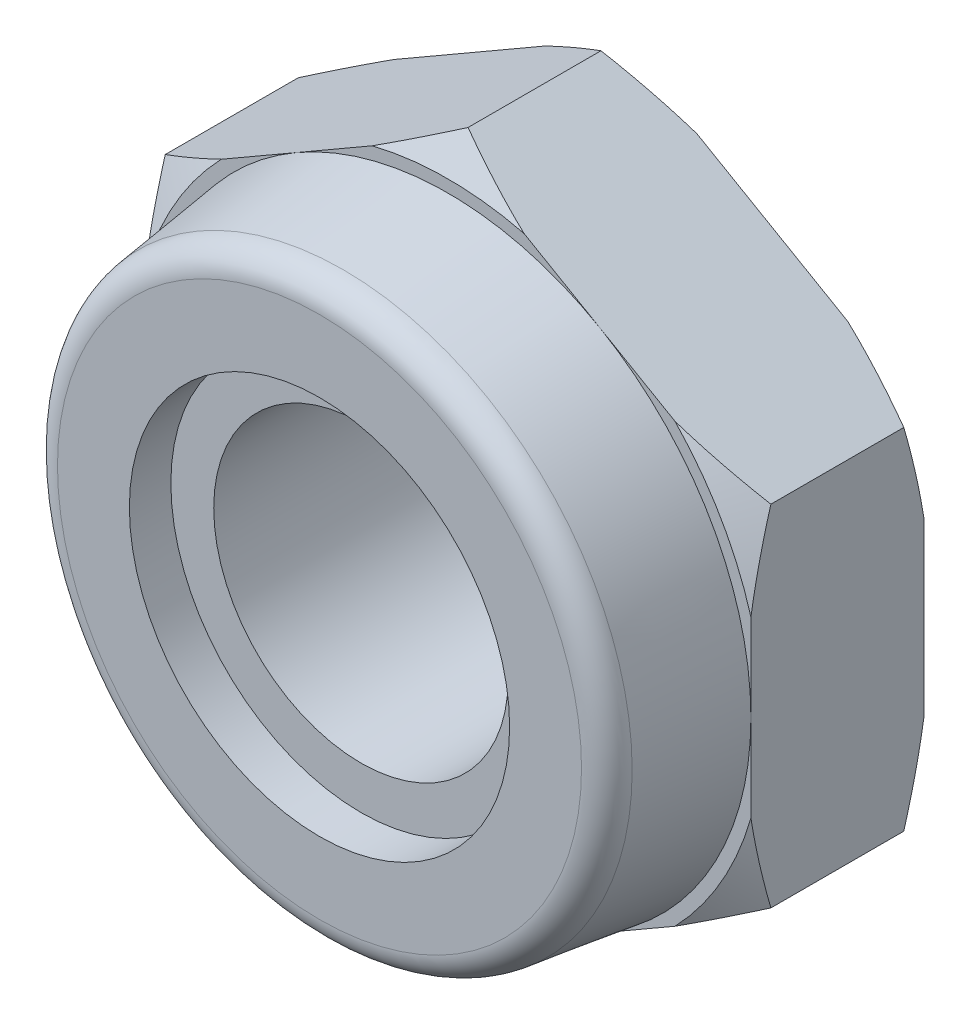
from build123d import *

# Parameters (mm, degrees)
BASENUTSKE_R  = 2.7051
BASENUT_DEPTH = 3.175


with BuildPart() as part:
    # BaseNutSke → BaseNut (new body)
    with BuildSketch(Plane.XY):
        Polygon((5.5626, -3.211568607), (5.5626, 3.211568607), (0, 6.423137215), (-5.5626, 3.211568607), (-5.5626, -3.211568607), (0, -6.423137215), align=None)
        Circle(BASENUTSKE_R, mode=Mode.SUBTRACT)
    extrude(amount=-BASENUT_DEPTH)

    # TorqEleSke → TorqueElement (revolve)
    with BuildSketch(Plane(origin=(0, 0, 0), x_dir=(0, 0, -1), z_dir=(0, 1, 0)), mode=Mode.PRIVATE) as torqueelement_sk:
        with BuildLine():
            Line((-1.6002, 3.4925), (-1.6002, 2.7051))
            Line((-1.6002, 2.7051), (0, 2.7051))
            Line((0, 2.7051), (0, 5.5626))
            Line((0, 5.5626), (-1.927463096, 5.308844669))
            ThreePointArc((-1.927463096, 5.308844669), (-2.238119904, 5.142795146), (-2.3622, 4.813122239))
            Line((-2.3622, 4.813122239), (-2.3622, 3.4925))
            Line((-2.3622, 3.4925), (-1.6002, 3.4925))
        make_face()
    revolve(torqueelement_sk.sketch.rotate(Axis((0, 0, 9.480888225), (0, 0, -1)), 180), axis=Axis((0, 0, 9.480888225), (0, 0, -1)))

    # Sketch3 → DoubleChamfer (revolve, cut)
    with BuildSketch(Plane(origin=(0, 0, 0), x_dir=(0, 0, -1), z_dir=(1, 0, 0))):
        Polygon((3.175, 5.788137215), (2.808382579, 6.423137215), (3.175, 6.423137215), align=None)
        Polygon((0, 6.423137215), (0, 5.788137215), (0.366617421, 6.423137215), align=None)
    revolve(axis=Axis((0, 0, 0), (0, 0, -1)), mode=Mode.SUBTRACT)

    # ThdSchSke → ThreadSchematic (revolve, cut)
    with BuildSketch(Plane(origin=(0, 0, 0), x_dir=(1, 0, 0), z_dir=(0, 1, 0)), mode=Mode.PRIVATE) as threadschematic_sk:
        Polygon((-3.175, 3.175), (-2.7051, 3.446296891), (-2.7051, 2.903703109), align=None)
    revolve(threadschematic_sk.sketch.rotate(Axis((0, 0, 1.481463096), (0, 0, 1)), 180), axis=Axis((0, 0, 1.481463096), (0, 0, 1)), mode=Mode.SUBTRACT)


solid = part.part
